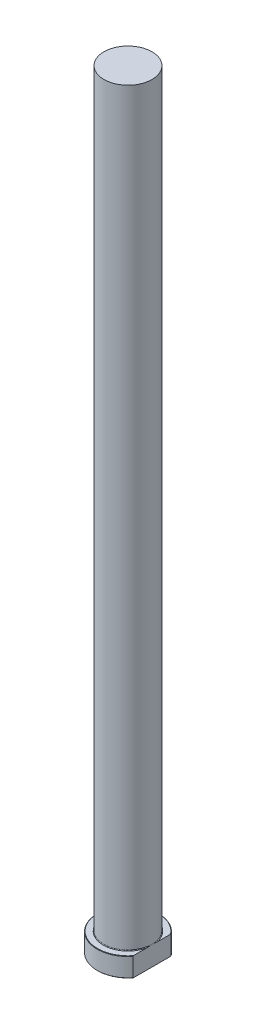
ISO-10303-21;
HEADER;
FILE_DESCRIPTION(('STEP AP214'),'2;1');
FILE_NAME('part.step','',(''),(''),'','','');
FILE_SCHEMA(('AUTOMOTIVE_DESIGN { 1 0 10303 214 1 1 1 1 }'));
ENDSEC;
DATA;
#1=APPLICATION_CONTEXT('core data for automotive mechanical design processes');
#2=APPLICATION_PROTOCOL_DEFINITION('international standard','automotive_design',2000,#1);
#3=PRODUCT_CONTEXT('',#1,'mechanical');
#4=PRODUCT('Part','Part','',(#3));
#5=PRODUCT_RELATED_PRODUCT_CATEGORY('part','',(#4));
#6=PRODUCT_DEFINITION_FORMATION('','',#4);
#7=PRODUCT_DEFINITION_CONTEXT('part definition',#1,'design');
#8=PRODUCT_DEFINITION('design','',#6,#7);
#9=PRODUCT_DEFINITION_SHAPE('','',#8);
#10=(LENGTH_UNIT() NAMED_UNIT(*) SI_UNIT(.MILLI.,.METRE.));
#11=(NAMED_UNIT(*) PLANE_ANGLE_UNIT() SI_UNIT($,.RADIAN.));
#12=(NAMED_UNIT(*) SI_UNIT($,.STERADIAN.) SOLID_ANGLE_UNIT());
#13=UNCERTAINTY_MEASURE_WITH_UNIT(LENGTH_MEASURE(1.E-05),#10,'distance_accuracy_value','');
#14=(GEOMETRIC_REPRESENTATION_CONTEXT(3) GLOBAL_UNCERTAINTY_ASSIGNED_CONTEXT((#13)) GLOBAL_UNIT_ASSIGNED_CONTEXT((#10,
#11,#12)) REPRESENTATION_CONTEXT('',''));
#15=CARTESIAN_POINT('',(0.,0.,0.));
#16=DIRECTION('',(0.,0.,1.));
#17=DIRECTION('',(1.,0.,0.));
#18=AXIS2_PLACEMENT_3D('',#15,#16,#17);
#19=CARTESIAN_POINT('',(0.,0.,0.));
#20=DIRECTION('',(0.,-1.,0.));
#21=DIRECTION('',(0.,0.,-1.));
#22=AXIS2_PLACEMENT_3D('',#19,#20,#21);
#23=PLANE('',#22);
#24=CARTESIAN_POINT('',(0.,0.,0.));
#25=DIRECTION('',(0.,-1.,0.));
#26=DIRECTION('',(0.,0.,-1.));
#27=AXIS2_PLACEMENT_3D('',#24,#25,#26);
#28=CIRCLE('',#27,15.8);
#29=CARTESIAN_POINT('',(12.5,0.,9.66385016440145));
#30=VERTEX_POINT('',#29);
#31=CARTESIAN_POINT('',(12.5,0.,-9.66385016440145));
#32=VERTEX_POINT('',#31);
#33=EDGE_CURVE('E98',#30,#32,#28,.T.);
#34=ORIENTED_EDGE('',*,*,#33,.T.);
#35=DIRECTION('',(0.,0.,1.));
#36=VECTOR('',#35,1.);
#37=CARTESIAN_POINT('',(12.5,0.,-9.98749217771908));
#38=LINE('',#37,#36);
#39=EDGE_CURVE('E83',#32,#30,#38,.T.);
#40=ORIENTED_EDGE('',*,*,#39,.T.);
#41=EDGE_LOOP('',(#34,#40));
#42=FACE_BOUND('',#41,.T.);
#43=ADVANCED_FACE('F32',(#42),#23,.T.);
#44=CARTESIAN_POINT('',(0.,259.958771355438,0.));
#45=DIRECTION('',(0.,1.,0.));
#46=DIRECTION('',(0.,0.,1.));
#47=AXIS2_PLACEMENT_3D('',#44,#45,#46);
#48=CYLINDRICAL_SURFACE('',#47,16.);
#49=CARTESIAN_POINT('',(0.,9.80000000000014,0.));
#50=DIRECTION('',(0.,1.,0.));
#51=DIRECTION('',(0.,0.,1.));
#52=AXIS2_PLACEMENT_3D('',#49,#50,#51);
#53=CIRCLE('',#52,16.);
#54=CARTESIAN_POINT('',(12.5,9.80000000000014,9.98749217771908));
#55=VERTEX_POINT('',#54);
#56=CARTESIAN_POINT('',(12.5,9.80000000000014,-9.98749217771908));
#57=VERTEX_POINT('',#56);
#58=EDGE_CURVE('E104',#55,#57,#53,.F.);
#59=ORIENTED_EDGE('',*,*,#58,.T.);
#60=DIRECTION('',(0.,-1.,0.));
#61=VECTOR('',#60,1.);
#62=CARTESIAN_POINT('',(12.5,400.,-9.98749217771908));
#63=LINE('',#62,#61);
#64=CARTESIAN_POINT('',(12.5,0.199999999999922,-9.98749217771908));
#65=VERTEX_POINT('',#64);
#66=EDGE_CURVE('E183',#57,#65,#63,.T.);
#67=ORIENTED_EDGE('',*,*,#66,.T.);
#68=CARTESIAN_POINT('',(0.,0.199999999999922,0.));
#69=DIRECTION('',(0.,-1.,0.));
#70=DIRECTION('',(0.,0.,-1.));
#71=AXIS2_PLACEMENT_3D('',#68,#69,#70);
#72=CIRCLE('',#71,16.);
#73=CARTESIAN_POINT('',(12.5,0.199999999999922,9.98749217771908));
#74=VERTEX_POINT('',#73);
#75=EDGE_CURVE('E100',#65,#74,#72,.F.);
#76=ORIENTED_EDGE('',*,*,#75,.T.);
#77=DIRECTION('',(0.,-1.,0.));
#78=VECTOR('',#77,1.);
#79=CARTESIAN_POINT('',(12.5,400.,9.98749217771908));
#80=LINE('',#79,#78);
#81=EDGE_CURVE('E93',#55,#74,#80,.T.);
#82=ORIENTED_EDGE('',*,*,#81,.F.);
#83=EDGE_LOOP('',(#59,#67,#76,#82));
#84=FACE_BOUND('',#83,.T.);
#85=ADVANCED_FACE('F158',(#84),#48,.T.);
#86=CARTESIAN_POINT('',(-16.,10.,0.));
#87=DIRECTION('',(0.,1.,0.));
#88=DIRECTION('',(0.,0.,1.));
#89=AXIS2_PLACEMENT_3D('',#86,#87,#88);
#90=PLANE('',#89);
#91=CARTESIAN_POINT('',(0.,10.,0.));
#92=DIRECTION('',(0.,1.,0.));
#93=DIRECTION('',(0.,0.,1.));
#94=AXIS2_PLACEMENT_3D('',#91,#92,#93);
#95=CIRCLE('',#94,15.8000000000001);
#96=CARTESIAN_POINT('',(12.5,10.,-9.66385016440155));
#97=VERTEX_POINT('',#96);
#98=CARTESIAN_POINT('',(12.5,10.,9.66385016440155));
#99=VERTEX_POINT('',#98);
#100=EDGE_CURVE('E178',#97,#99,#95,.T.);
#101=ORIENTED_EDGE('',*,*,#100,.T.);
#102=DIRECTION('',(0.,0.,-1.));
#103=VECTOR('',#102,1.);
#104=CARTESIAN_POINT('',(12.5,10.,0.));
#105=LINE('',#104,#103);
#106=CARTESIAN_POINT('',(12.5,10.,2.75499546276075));
#107=VERTEX_POINT('',#106);
#108=EDGE_CURVE('E57',#99,#107,#105,.T.);
#109=ORIENTED_EDGE('',*,*,#108,.T.);
#110=CARTESIAN_POINT('',(0.,10.,0.));
#111=DIRECTION('',(0.,1.,0.));
#112=DIRECTION('',(0.,0.,1.));
#113=AXIS2_PLACEMENT_3D('',#110,#111,#112);
#114=CIRCLE('',#113,12.8);
#115=CARTESIAN_POINT('',(12.5,10.,-2.75499546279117));
#116=VERTEX_POINT('',#115);
#117=EDGE_CURVE('E107',#107,#116,#114,.F.);
#118=ORIENTED_EDGE('',*,*,#117,.T.);
#119=EDGE_CURVE('E136',#116,#97,#105,.T.);
#120=ORIENTED_EDGE('',*,*,#119,.T.);
#121=EDGE_LOOP('',(#101,#109,#118,#120));
#122=FACE_BOUND('',#121,.T.);
#123=ADVANCED_FACE('F147',(#122),#90,.T.);
#124=CARTESIAN_POINT('',(0.,10.,0.));
#125=DIRECTION('',(0.,-1.,0.));
#126=DIRECTION('',(0.,0.,-1.));
#127=AXIS2_PLACEMENT_3D('',#124,#125,#126);
#128=CONICAL_SURFACE('',#127,15.8000000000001,0.785398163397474);
#129=ORIENTED_EDGE('',*,*,#58,.F.);
#130=CARTESIAN_POINT('',(12.5,0.520063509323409,21.9732835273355));
#131=CARTESIAN_POINT('',(12.5,0.802025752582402,21.6488770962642));
#132=CARTESIAN_POINT('',(12.5,1.08313217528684,21.3237240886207));
#133=CARTESIAN_POINT('',(12.5,1.64338244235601,20.6717229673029));
#134=CARTESIAN_POINT('',(12.5,1.9225262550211,20.3448748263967));
#135=CARTESIAN_POINT('',(12.5,2.47872061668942,19.689139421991));
#136=CARTESIAN_POINT('',(12.5,2.75577013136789,19.3602512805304));
#137=CARTESIAN_POINT('',(12.5,3.30732757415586,18.7003513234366));
#138=CARTESIAN_POINT('',(12.5,3.58183551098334,18.3693395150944));
#139=CARTESIAN_POINT('',(12.5,4.13404626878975,17.6974852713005));
#140=CARTESIAN_POINT('',(12.5,4.411683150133,17.3565885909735));
#141=CARTESIAN_POINT('',(12.5,4.96342557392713,16.6719500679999));
#142=CARTESIAN_POINT('',(12.5,5.23753113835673,16.3282082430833));
#143=CARTESIAN_POINT('',(12.5,5.7815597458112,15.6375575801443));
#144=CARTESIAN_POINT('',(12.5,6.05148375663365,15.2906495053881));
#145=CARTESIAN_POINT('',(12.5,6.58649101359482,14.5931154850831));
#146=CARTESIAN_POINT('',(12.5,6.85157426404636,14.2424895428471));
#147=CARTESIAN_POINT('',(12.5,7.3763396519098,13.5365100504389));
#148=CARTESIAN_POINT('',(12.5,7.6360143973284,13.1811509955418));
#149=CARTESIAN_POINT('',(12.5,8.14848411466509,12.4654890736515));
#150=CARTESIAN_POINT('',(12.5,8.40127901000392,12.1051861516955));
#151=CARTESIAN_POINT('',(12.5,8.89877262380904,11.3785626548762));
#152=CARTESIAN_POINT('',(12.5,9.14346420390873,11.0122371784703));
#153=CARTESIAN_POINT('',(12.5,9.62269650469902,10.272992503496));
#154=CARTESIAN_POINT('',(12.5,9.8572374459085,9.90007344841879));
#155=CARTESIAN_POINT('',(12.5,10.3121733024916,9.14938704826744));
#156=CARTESIAN_POINT('',(12.5,10.5326589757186,8.77167495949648));
#157=CARTESIAN_POINT('',(12.5,10.958432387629,8.00766886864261));
#158=CARTESIAN_POINT('',(12.5,11.1637182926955,7.62137383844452));
#159=CARTESIAN_POINT('',(12.5,11.5550521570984,6.83979556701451));
#160=CARTESIAN_POINT('',(12.5,11.7411279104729,6.44452635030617));
#161=CARTESIAN_POINT('',(12.5,12.0896891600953,5.64379531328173));
#162=CARTESIAN_POINT('',(12.5,12.2521837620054,5.23833749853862));
#163=CARTESIAN_POINT('',(12.5,12.5515074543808,4.40750298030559));
#164=CARTESIAN_POINT('',(12.5,12.6876692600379,3.98188300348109));
#165=CARTESIAN_POINT('',(12.5,12.923066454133,3.12036018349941));
#166=CARTESIAN_POINT('',(12.5,13.0223077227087,2.68445898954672));
#167=CARTESIAN_POINT('',(12.5,13.1386499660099,2.02637177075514));
#168=CARTESIAN_POINT('',(12.5,13.1719581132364,1.80697979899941));
#169=CARTESIAN_POINT('',(12.5,13.2273896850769,1.36679892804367));
#170=CARTESIAN_POINT('',(12.5,13.2495147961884,1.14601024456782));
#171=CARTESIAN_POINT('',(12.5,13.2821590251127,0.70357819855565));
#172=CARTESIAN_POINT('',(12.5,13.2926782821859,0.481934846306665));
#173=CARTESIAN_POINT('',(12.5,13.3019073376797,0.0383999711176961));
#174=CARTESIAN_POINT('',(12.5,13.3006171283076,-0.18349155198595));
#175=CARTESIAN_POINT('',(12.5,13.2862386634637,-0.627300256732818));
#176=CARTESIAN_POINT('',(12.5,13.2731286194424,-0.849216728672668));
#177=CARTESIAN_POINT('',(12.5,13.2353379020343,-1.29205679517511));
#178=CARTESIAN_POINT('',(12.5,13.2106571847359,-1.51298038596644));
#179=CARTESIAN_POINT('',(12.5,13.1501829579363,-1.9533130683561));
#180=CARTESIAN_POINT('',(12.5,13.1143886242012,-2.17272204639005));
#181=CARTESIAN_POINT('',(12.5,13.0323124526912,-2.60958138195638));
#182=CARTESIAN_POINT('',(12.5,12.986029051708,-2.82703144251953));
#183=CARTESIAN_POINT('',(12.5,12.831800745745,-3.47896053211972));
#184=CARTESIAN_POINT('',(12.5,12.7089145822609,-3.90995974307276));
#185=CARTESIAN_POINT('',(12.5,12.4301044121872,-4.76088311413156));
#186=CARTESIAN_POINT('',(12.5,12.2741797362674,-5.18080704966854));
#187=CARTESIAN_POINT('',(12.5,11.8998555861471,-6.09704545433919));
#188=CARTESIAN_POINT('',(12.5,11.6752155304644,-6.59079268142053));
#189=CARTESIAN_POINT('',(12.5,11.195925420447,-7.5636180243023));
#190=CARTESIAN_POINT('',(12.5,10.9412581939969,-8.04268754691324));
#191=CARTESIAN_POINT('',(12.5,10.4085643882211,-8.98884891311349));
#192=CARTESIAN_POINT('',(12.5,10.1304909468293,-9.45591416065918));
#193=CARTESIAN_POINT('',(12.5,9.55679554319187,-10.3789360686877));
#194=CARTESIAN_POINT('',(12.5,9.26117703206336,-10.8348948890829));
#195=CARTESIAN_POINT('',(12.5,8.65460060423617,-11.7400212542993));
#196=CARTESIAN_POINT('',(12.5,8.34356847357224,-12.1891388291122));
#197=CARTESIAN_POINT('',(12.5,7.71056360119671,-13.0795913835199));
#198=CARTESIAN_POINT('',(12.5,7.38859046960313,-13.5209260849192));
#199=CARTESIAN_POINT('',(12.5,6.73627073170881,-14.3965599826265));
#200=CARTESIAN_POINT('',(12.5,6.40593412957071,-14.8308666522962));
#201=CARTESIAN_POINT('',(12.5,5.73818513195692,-15.69398428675));
#202=CARTESIAN_POINT('',(12.5,5.4007728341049,-16.1227953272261));
#203=CARTESIAN_POINT('',(12.5,4.69065889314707,-17.0127103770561));
#204=CARTESIAN_POINT('',(12.5,4.31743190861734,-17.473394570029));
#205=CARTESIAN_POINT('',(12.5,3.56536441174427,-18.3901509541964));
#206=CARTESIAN_POINT('',(12.5,3.18652389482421,-18.8462231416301));
#207=CARTESIAN_POINT('',(12.5,2.42850462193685,-19.7493414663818));
#208=CARTESIAN_POINT('',(12.5,2.04937794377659,-20.1964313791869));
#209=CARTESIAN_POINT('',(12.5,1.28737664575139,-21.0872319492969));
#210=CARTESIAN_POINT('',(12.5,0.90450289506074,-21.5309433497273));
#211=CARTESIAN_POINT('',(12.5,0.520063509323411,-21.9732835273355));
#212=B_SPLINE_CURVE_WITH_KNOTS('',3,(#130,#131,#132,#133,#134,#135,#136,#137,#138,#139,#140,
#141,#142,#143,#144,#145,#146,#147,#148,#149,#150,#151,#152,#153,#154,#155,#156,#157,#158,#159,
#160,#161,#162,#163,#164,#165,#166,#167,#168,#169,#170,#171,#172,#173,#174,#175,#176,#177,#178,
#179,#180,#181,#182,#183,#184,#185,#186,#187,#188,#189,#190,#191,#192,#193,#194,#195,#196,#197,
#198,#199,#200,#201,#202,#203,#204,#205,#206,#207,#208,#209,#210,#211),.UNSPECIFIED.,.F.,.F.,(4,
2,2,2,2,2,2,2,2,2,2,2,2,2,2,2,2,2,2,2,2,2,2,2,2,2,2,2,2,2,2,2,2,2,2,2,2,2,2,2,4),(0.,
1.28945110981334,2.57892299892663,3.86899482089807,5.15906221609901,6.47799420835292,
7.79691798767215,9.11553180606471,10.4341444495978,11.7544545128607,13.0747792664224,
14.3962377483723,15.7176675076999,17.0294519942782,18.3413944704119,19.6514113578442,
20.9609210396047,22.3001940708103,23.6392537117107,24.3047314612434,24.9701088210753,
25.6354781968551,26.3008480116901,26.9674468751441,27.6340482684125,28.3006991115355,
28.9674493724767,30.3101828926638,31.6529436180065,33.2788964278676,34.9057836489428,
36.5360093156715,38.1659153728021,39.804623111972,41.4433893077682,43.0802801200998,
44.7171483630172,46.4957886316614,48.274430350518,50.0329971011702,51.7911651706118),.UNSPECIFIED.);
#213=EDGE_CURVE('E135',#55,#99,#212,.T.);
#214=ORIENTED_EDGE('',*,*,#213,.T.);
#215=ORIENTED_EDGE('',*,*,#100,.F.);
#216=EDGE_CURVE('E127',#97,#57,#212,.T.);
#217=ORIENTED_EDGE('',*,*,#216,.T.);
#218=EDGE_LOOP('',(#129,#214,#215,#217));
#219=FACE_BOUND('',#218,.T.);
#220=ADVANCED_FACE('F143',(#219),#128,.T.);
#221=CARTESIAN_POINT('',(0.,0.199999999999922,0.));
#222=DIRECTION('',(0.,1.,0.));
#223=DIRECTION('',(0.,0.,1.));
#224=AXIS2_PLACEMENT_3D('',#221,#222,#223);
#225=CONICAL_SURFACE('',#224,16.,0.785398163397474);
#226=ORIENTED_EDGE('',*,*,#75,.F.);
#227=CARTESIAN_POINT('',(12.5,9.47993649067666,-21.9732835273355));
#228=CARTESIAN_POINT('',(12.5,9.19797424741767,-21.6488770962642));
#229=CARTESIAN_POINT('',(12.5,8.91686782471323,-21.3237240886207));
#230=CARTESIAN_POINT('',(12.5,8.35661755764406,-20.6717229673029));
#231=CARTESIAN_POINT('',(12.5,8.07747374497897,-20.3448748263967));
#232=CARTESIAN_POINT('',(12.5,7.52127938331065,-19.689139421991));
#233=CARTESIAN_POINT('',(12.5,7.24422986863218,-19.3602512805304));
#234=CARTESIAN_POINT('',(12.5,6.69267242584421,-18.7003513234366));
#235=CARTESIAN_POINT('',(12.5,6.41816448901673,-18.3693395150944));
#236=CARTESIAN_POINT('',(12.5,5.86595373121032,-17.6974852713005));
#237=CARTESIAN_POINT('',(12.5,5.58831684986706,-17.3565885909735));
#238=CARTESIAN_POINT('',(12.5,5.03657442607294,-16.6719500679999));
#239=CARTESIAN_POINT('',(12.5,4.76246886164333,-16.3282082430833));
#240=CARTESIAN_POINT('',(12.5,4.21844025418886,-15.6375575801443));
#241=CARTESIAN_POINT('',(12.5,3.94851624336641,-15.2906495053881));
#242=CARTESIAN_POINT('',(12.5,3.41350898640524,-14.5931154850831));
#243=CARTESIAN_POINT('',(12.5,3.14842573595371,-14.2424895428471));
#244=CARTESIAN_POINT('',(12.5,2.62366034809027,-13.5365100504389));
#245=CARTESIAN_POINT('',(12.5,2.36398560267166,-13.1811509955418));
#246=CARTESIAN_POINT('',(12.5,1.85151588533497,-12.4654890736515));
#247=CARTESIAN_POINT('',(12.5,1.59872098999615,-12.1051861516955));
#248=CARTESIAN_POINT('',(12.5,1.10122737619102,-11.3785626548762));
#249=CARTESIAN_POINT('',(12.5,0.856535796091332,-11.0122371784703));
#250=CARTESIAN_POINT('',(12.5,0.377303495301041,-10.272992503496));
#251=CARTESIAN_POINT('',(12.5,0.142762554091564,-9.90007344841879));
#252=CARTESIAN_POINT('',(12.5,-0.312173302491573,-9.14938704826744));
#253=CARTESIAN_POINT('',(12.5,-0.532658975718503,-8.77167495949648));
#254=CARTESIAN_POINT('',(12.5,-0.958432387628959,-8.00766886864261));
#255=CARTESIAN_POINT('',(12.5,-1.16371829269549,-7.62137383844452));
#256=CARTESIAN_POINT('',(12.5,-1.55505215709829,-6.83979556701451));
#257=CARTESIAN_POINT('',(12.5,-1.74112791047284,-6.44452635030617));
#258=CARTESIAN_POINT('',(12.5,-2.08968916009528,-5.64379531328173));
#259=CARTESIAN_POINT('',(12.5,-2.25218376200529,-5.23833749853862));
#260=CARTESIAN_POINT('',(12.5,-2.55150745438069,-4.40750298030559));
#261=CARTESIAN_POINT('',(12.5,-2.68766926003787,-3.98188300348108));
#262=CARTESIAN_POINT('',(12.5,-2.92306645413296,-3.1203601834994));
#263=CARTESIAN_POINT('',(12.5,-3.02230772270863,-2.68445898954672));
#264=CARTESIAN_POINT('',(12.5,-3.13864996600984,-2.02637177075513));
#265=CARTESIAN_POINT('',(12.5,-3.17195811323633,-1.80697979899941));
#266=CARTESIAN_POINT('',(12.5,-3.22738968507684,-1.36679892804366));
#267=CARTESIAN_POINT('',(12.5,-3.24951479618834,-1.14601024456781));
#268=CARTESIAN_POINT('',(12.5,-3.28215902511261,-0.703578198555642));
#269=CARTESIAN_POINT('',(12.5,-3.29267828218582,-0.481934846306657));
#270=CARTESIAN_POINT('',(12.5,-3.30190733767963,-0.038399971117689));
#271=CARTESIAN_POINT('',(12.5,-3.30061712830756,0.183491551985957));
#272=CARTESIAN_POINT('',(12.5,-3.28623866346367,0.627300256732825));
#273=CARTESIAN_POINT('',(12.5,-3.27312861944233,0.849216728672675));
#274=CARTESIAN_POINT('',(12.5,-3.23533790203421,1.29205679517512));
#275=CARTESIAN_POINT('',(12.5,-3.21065718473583,1.51298038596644));
#276=CARTESIAN_POINT('',(12.5,-3.15018295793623,1.95331306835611));
#277=CARTESIAN_POINT('',(12.5,-3.11438862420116,2.17272204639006));
#278=CARTESIAN_POINT('',(12.5,-3.03231245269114,2.60958138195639));
#279=CARTESIAN_POINT('',(12.5,-2.98602905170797,2.82703144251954));
#280=CARTESIAN_POINT('',(12.5,-2.83180074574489,3.47896053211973));
#281=CARTESIAN_POINT('',(12.5,-2.70891458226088,3.90995974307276));
#282=CARTESIAN_POINT('',(12.5,-2.43010441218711,4.76088311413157));
#283=CARTESIAN_POINT('',(12.5,-2.27417973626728,5.18080704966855));
#284=CARTESIAN_POINT('',(12.5,-1.89985558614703,6.09704545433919));
#285=CARTESIAN_POINT('',(12.5,-1.67521553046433,6.59079268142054));
#286=CARTESIAN_POINT('',(12.5,-1.19592542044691,7.56361802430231));
#287=CARTESIAN_POINT('',(12.5,-0.941258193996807,8.04268754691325));
#288=CARTESIAN_POINT('',(12.5,-0.408564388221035,8.98884891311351));
#289=CARTESIAN_POINT('',(12.5,-0.130490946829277,9.45591416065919));
#290=CARTESIAN_POINT('',(12.5,0.443204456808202,10.3789360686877));
#291=CARTESIAN_POINT('',(12.5,0.738822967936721,10.8348948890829));
#292=CARTESIAN_POINT('',(12.5,1.34539939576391,11.7400212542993));
#293=CARTESIAN_POINT('',(12.5,1.65643152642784,12.1891388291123));
#294=CARTESIAN_POINT('',(12.5,2.28943639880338,13.0795913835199));
#295=CARTESIAN_POINT('',(12.5,2.61140953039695,13.5209260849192));
#296=CARTESIAN_POINT('',(12.5,3.26372926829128,14.3965599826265));
#297=CARTESIAN_POINT('',(12.5,3.59406587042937,14.8308666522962));
#298=CARTESIAN_POINT('',(12.5,4.26181486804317,15.69398428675));
#299=CARTESIAN_POINT('',(12.5,4.59922716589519,16.1227953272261));
#300=CARTESIAN_POINT('',(12.5,5.30934110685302,17.0127103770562));
#301=CARTESIAN_POINT('',(12.5,5.68256809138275,17.473394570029));
#302=CARTESIAN_POINT('',(12.5,6.43463558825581,18.3901509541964));
#303=CARTESIAN_POINT('',(12.5,6.81347610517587,18.8462231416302));
#304=CARTESIAN_POINT('',(12.5,7.57149537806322,19.7493414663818));
#305=CARTESIAN_POINT('',(12.5,7.95062205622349,20.1964313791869));
#306=CARTESIAN_POINT('',(12.5,8.71262335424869,21.0872319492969));
#307=CARTESIAN_POINT('',(12.5,9.09549710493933,21.5309433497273));
#308=CARTESIAN_POINT('',(12.5,9.47993649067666,21.9732835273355));
#309=B_SPLINE_CURVE_WITH_KNOTS('',3,(#227,#228,#229,#230,#231,#232,#233,#234,#235,#236,#237,
#238,#239,#240,#241,#242,#243,#244,#245,#246,#247,#248,#249,#250,#251,#252,#253,#254,#255,#256,
#257,#258,#259,#260,#261,#262,#263,#264,#265,#266,#267,#268,#269,#270,#271,#272,#273,#274,#275,
#276,#277,#278,#279,#280,#281,#282,#283,#284,#285,#286,#287,#288,#289,#290,#291,#292,#293,#294,
#295,#296,#297,#298,#299,#300,#301,#302,#303,#304,#305,#306,#307,#308),.UNSPECIFIED.,.F.,.F.,(4,
2,2,2,2,2,2,2,2,2,2,2,2,2,2,2,2,2,2,2,2,2,2,2,2,2,2,2,2,2,2,2,2,2,2,2,2,2,2,2,4),(0.,
1.28945110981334,2.57892299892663,3.86899482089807,5.15906221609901,6.47799420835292,
7.79691798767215,9.11553180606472,10.4341444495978,11.7544545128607,13.0747792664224,
14.3962377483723,15.7176675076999,17.0294519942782,18.3413944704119,19.6514113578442,
20.9609210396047,22.3001940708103,23.6392537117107,24.3047314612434,24.9701088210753,
25.6354781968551,26.3008480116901,26.9674468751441,27.6340482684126,28.3006991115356,
28.9674493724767,30.3101828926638,31.6529436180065,33.2788964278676,34.9057836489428,
36.5360093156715,38.1659153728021,39.8046231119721,41.4433893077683,43.0802801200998,
44.7171483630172,46.4957886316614,48.2744303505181,50.0329971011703,51.7911651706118),.UNSPECIFIED.);
#310=EDGE_CURVE('E86',#65,#32,#309,.T.);
#311=ORIENTED_EDGE('',*,*,#310,.T.);
#312=ORIENTED_EDGE('',*,*,#33,.F.);
#313=EDGE_CURVE('E89',#30,#74,#309,.T.);
#314=ORIENTED_EDGE('',*,*,#313,.T.);
#315=EDGE_LOOP('',(#226,#311,#312,#314));
#316=FACE_BOUND('',#315,.T.);
#317=ADVANCED_FACE('F97',(#316),#225,.T.);
#318=CARTESIAN_POINT('',(0.,10.3,0.));
#319=DIRECTION('',(0.,1.,0.));
#320=DIRECTION('',(0.,0.,1.));
#321=AXIS2_PLACEMENT_3D('',#318,#319,#320);
#322=TOROIDAL_SURFACE('',#321,12.8,0.3);
#323=CARTESIAN_POINT('',(12.5,10.3,0.));
#324=CARTESIAN_POINT('',(12.5,10.300000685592,-6.08820746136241E-09));
#325=CARTESIAN_POINT('',(12.5,10.300001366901,-5.08876655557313E-07));
#326=CARTESIAN_POINT('',(12.5,10.3000026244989,-1.73661802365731E-06));
#327=CARTESIAN_POINT('',(12.5,10.3000031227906,-2.48490474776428E-06));
#328=CARTESIAN_POINT('',(12.5,10.3000042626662,-4.35291163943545E-06));
#329=CARTESIAN_POINT('',(12.5,10.3000048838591,-5.50325566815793E-06));
#330=CARTESIAN_POINT('',(12.5,10.3000058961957,-7.76527023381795E-06));
#331=CARTESIAN_POINT('',(12.5,10.3000063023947,-8.87193032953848E-06));
#332=CARTESIAN_POINT('',(12.5,10.3000080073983,-1.35535117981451E-05));
#333=CARTESIAN_POINT('',(12.5,10.300009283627,-1.71478698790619E-05));
#334=CARTESIAN_POINT('',(12.5,10.3000111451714,-2.39305737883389E-05));
#335=CARTESIAN_POINT('',(12.5,10.30001180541,-2.70989461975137E-05));
#336=CARTESIAN_POINT('',(12.5,10.3000165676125,-5.05411717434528E-05));
#337=CARTESIAN_POINT('',(12.5,10.3000200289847,-7.09185071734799E-05));
#338=CARTESIAN_POINT('',(12.5,10.300032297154,-0.000151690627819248));
#339=CARTESIAN_POINT('',(12.5,10.3000383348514,-0.000212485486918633));
#340=CARTESIAN_POINT('',(12.5,10.3000659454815,-0.000448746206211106));
#341=CARTESIAN_POINT('',(12.5,10.3000952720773,-0.000623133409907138));
#342=CARTESIAN_POINT('',(12.5,10.3002039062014,-0.00128772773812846));
#343=CARTESIAN_POINT('',(12.5,10.3002776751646,-0.00177866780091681));
#344=CARTESIAN_POINT('',(12.5,10.3005641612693,-0.00366503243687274));
#345=CARTESIAN_POINT('',(12.5,10.3007823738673,-0.00505974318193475));
#346=CARTESIAN_POINT('',(12.5,10.3018133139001,-0.0116680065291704));
#347=CARTESIAN_POINT('',(12.5,10.3026180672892,-0.0168825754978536));
#348=CARTESIAN_POINT('',(12.5,10.3120514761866,-0.0779781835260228));
#349=CARTESIAN_POINT('',(12.5,10.3207244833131,-0.133853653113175));
#350=CARTESIAN_POINT('',(12.5,10.3388658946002,-0.251282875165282));
#351=CARTESIAN_POINT('',(12.5,10.3483257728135,-0.312837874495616));
#352=CARTESIAN_POINT('',(12.5,10.3639287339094,-0.415046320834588));
#353=CARTESIAN_POINT('',(12.5,10.3701065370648,-0.455694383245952));
#354=CARTESIAN_POINT('',(12.5,10.3822268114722,-0.53596333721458));
#355=CARTESIAN_POINT('',(12.5,10.3881712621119,-0.57558393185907));
#356=CARTESIAN_POINT('',(12.5,10.4217048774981,-0.800849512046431));
#357=CARTESIAN_POINT('',(12.5,10.4483430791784,-0.986638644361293));
#358=CARTESIAN_POINT('',(12.5,10.4978676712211,-1.36073085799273));
#359=CARTESIAN_POINT('',(12.5,10.5207116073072,-1.54903981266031));
#360=CARTESIAN_POINT('',(12.5,10.5510813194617,-1.84372746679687));
#361=CARTESIAN_POINT('',(12.5,10.5609338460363,-1.94986334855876));
#362=CARTESIAN_POINT('',(12.5,10.5778401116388,-2.16235517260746));
#363=CARTESIAN_POINT('',(12.5,10.5848941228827,-2.26871109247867));
#364=CARTESIAN_POINT('',(12.5,10.5953321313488,-2.48120575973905));
#365=CARTESIAN_POINT('',(12.5,10.5987299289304,-2.58734380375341));
#366=CARTESIAN_POINT('',(12.5,10.6006981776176,-2.79965289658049));
#367=CARTESIAN_POINT('',(12.5,10.5992708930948,-2.90582390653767));
#368=CARTESIAN_POINT('',(12.5,10.5920660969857,-3.06242328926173));
#369=CARTESIAN_POINT('',(12.5,10.5889531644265,-3.11297361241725));
#370=CARTESIAN_POINT('',(12.5,10.5807735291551,-3.21396863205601));
#371=CARTESIAN_POINT('',(12.5,10.5757051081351,-3.26441319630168));
#372=CARTESIAN_POINT('',(12.5,10.5631618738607,-3.36425835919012));
#373=CARTESIAN_POINT('',(12.5,10.555723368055,-3.41366343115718));
#374=CARTESIAN_POINT('',(12.5,10.5375916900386,-3.51185380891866));
#375=CARTESIAN_POINT('',(12.5,10.5269024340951,-3.56063978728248));
#376=CARTESIAN_POINT('',(12.5,10.5054348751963,-3.6391830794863));
#377=CARTESIAN_POINT('',(12.5,10.4961365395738,-3.66933696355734));
#378=CARTESIAN_POINT('',(12.5,10.474763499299,-3.72862196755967));
#379=CARTESIAN_POINT('',(12.5,10.462694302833,-3.75775498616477));
#380=CARTESIAN_POINT('',(12.5,10.4380385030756,-3.80618627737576));
#381=CARTESIAN_POINT('',(12.5,10.4265070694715,-3.8259857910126));
#382=CARTESIAN_POINT('',(12.5,10.4063926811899,-3.85382979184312));
#383=CARTESIAN_POINT('',(12.5,10.3991733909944,-3.8628437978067));
#384=CARTESIAN_POINT('',(12.5,10.3835233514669,-3.87975615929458));
#385=CARTESIAN_POINT('',(12.5,10.3750969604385,-3.88765833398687));
#386=CARTESIAN_POINT('',(12.5,10.3611065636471,-3.89824999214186));
#387=CARTESIAN_POINT('',(12.5,10.3560749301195,-3.9016366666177));
#388=CARTESIAN_POINT('',(12.5,10.3455861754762,-3.90768435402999));
#389=CARTESIAN_POINT('',(12.5,10.3401292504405,-3.91034569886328));
#390=CARTESIAN_POINT('',(12.5,10.3287657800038,-3.91474619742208));
#391=CARTESIAN_POINT('',(12.5,10.3228544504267,-3.91647335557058));
#392=CARTESIAN_POINT('',(12.5,10.3108092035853,-3.91873417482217));
#393=CARTESIAN_POINT('',(12.5,10.3046756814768,-3.91926985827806));
#394=CARTESIAN_POINT('',(12.5,10.293185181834,-3.91908606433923));
#395=CARTESIAN_POINT('',(12.5,10.2878253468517,-3.91851265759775));
#396=CARTESIAN_POINT('',(12.5,10.2772818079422,-3.91645967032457));
#397=CARTESIAN_POINT('',(12.5,10.2720982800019,-3.91497921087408));
#398=CARTESIAN_POINT('',(12.5,10.2604757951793,-3.91068184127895));
#399=CARTESIAN_POINT('',(12.5,10.2541380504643,-3.90759459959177));
#400=CARTESIAN_POINT('',(12.5,10.2420308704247,-3.90046137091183));
#401=CARTESIAN_POINT('',(12.5,10.2362627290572,-3.89641326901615));
#402=CARTESIAN_POINT('',(12.5,10.2213149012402,-3.88449159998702));
#403=CARTESIAN_POINT('',(12.5,10.2126659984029,-3.87596096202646));
#404=CARTESIAN_POINT('',(12.5,10.1966439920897,-3.85778795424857));
#405=CARTESIAN_POINT('',(12.5,10.1892747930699,-3.84814232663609));
#406=CARTESIAN_POINT('',(12.5,10.1725709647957,-3.82389784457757));
#407=CARTESIAN_POINT('',(12.5,10.1637497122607,-3.80894948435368));
#408=CARTESIAN_POINT('',(12.5,10.1475318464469,-3.77828784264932));
#409=CARTESIAN_POINT('',(12.5,10.1401383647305,-3.76257297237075));
#410=CARTESIAN_POINT('',(12.5,10.1264047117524,-3.73059893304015));
#411=CARTESIAN_POINT('',(12.5,10.1200701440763,-3.71433738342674));
#412=CARTESIAN_POINT('',(12.5,10.1082745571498,-3.68152468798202));
#413=CARTESIAN_POINT('',(12.5,10.1028126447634,-3.66497385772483));
#414=CARTESIAN_POINT('',(12.5,10.0886990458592,-3.61898372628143));
#415=CARTESIAN_POINT('',(12.5,10.0807822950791,-3.58931942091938));
#416=CARTESIAN_POINT('',(12.5,10.0665587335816,-3.52960268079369));
#417=CARTESIAN_POINT('',(12.5,10.0602528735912,-3.49955002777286));
#418=CARTESIAN_POINT('',(12.5,10.0432020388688,-3.40892020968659));
#419=CARTESIAN_POINT('',(12.5,10.0343558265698,-3.34798718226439));
#420=CARTESIAN_POINT('',(12.5,10.0201228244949,-3.22565891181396));
#421=CARTESIAN_POINT('',(12.5,10.0147414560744,-3.16426309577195));
#422=CARTESIAN_POINT('',(12.5,10.0066240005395,-3.04138251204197));
#423=CARTESIAN_POINT('',(12.5,10.0038844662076,-2.97989796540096));
#424=CARTESIAN_POINT('',(12.5,10.0005131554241,-2.8577235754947));
#425=CARTESIAN_POINT('',(12.5,9.99985290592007,-2.79703443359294));
#426=CARTESIAN_POINT('',(12.5,10.0002004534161,-2.67565900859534));
#427=CARTESIAN_POINT('',(12.5,10.0012083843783,-2.61497272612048));
#428=CARTESIAN_POINT('',(12.5,10.0063170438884,-2.43292800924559));
#429=CARTESIAN_POINT('',(12.5,10.0125034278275,-2.31162822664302));
#430=CARTESIAN_POINT('',(12.5,10.028923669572,-2.06913309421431));
#431=CARTESIAN_POINT('',(12.5,10.0391638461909,-1.94793820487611));
#432=CARTESIAN_POINT('',(12.5,10.0626694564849,-1.70583328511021));
#433=CARTESIAN_POINT('',(12.5,10.0759352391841,-1.58492328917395));
#434=CARTESIAN_POINT('',(12.5,10.1189883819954,-1.22310927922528));
#435=CARTESIAN_POINT('',(12.5,10.1520738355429,-0.982605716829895));
#436=CARTESIAN_POINT('',(12.5,10.2222679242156,-0.502161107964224));
#437=CARTESIAN_POINT('',(12.5,10.2593775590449,-0.262220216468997));
#438=CARTESIAN_POINT('',(12.5,10.2965571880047,-0.0222236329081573));
#439=CARTESIAN_POINT('',(12.5,10.2965669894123,-0.0221603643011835));
#440=CARTESIAN_POINT('',(12.5,10.2972687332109,-0.017630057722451));
#441=CARTESIAN_POINT('',(12.5,10.2979552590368,-0.0131622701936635));
#442=CARTESIAN_POINT('',(12.5,10.2989608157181,-0.00672404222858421));
#443=CARTESIAN_POINT('',(12.5,10.2992709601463,-0.00475237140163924));
#444=CARTESIAN_POINT('',(12.5,10.299665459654,-0.00214447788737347));
#445=CARTESIAN_POINT('',(12.5,10.299760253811,-0.0015097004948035));
#446=CARTESIAN_POINT('',(12.5,10.2998957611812,-0.000678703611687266));
#447=CARTESIAN_POINT('',(12.5,10.2999287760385,-0.000481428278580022));
#448=CARTESIAN_POINT('',(12.5,10.2999592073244,-0.000219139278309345));
#449=CARTESIAN_POINT('',(12.5,10.2999655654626,-0.000155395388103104));
#450=CARTESIAN_POINT('',(12.5,10.2999789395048,-7.14631131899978E-05));
#451=CARTESIAN_POINT('',(12.5,10.2999826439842,-5.07827878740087E-05));
#452=CARTESIAN_POINT('',(12.5,10.2999877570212,-2.70484026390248E-05));
#453=CARTESIAN_POINT('',(12.5,10.2999884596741,-2.3870209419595E-05));
#454=CARTESIAN_POINT('',(12.5,10.2999904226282,-1.70721258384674E-05));
#455=CARTESIAN_POINT('',(12.5,10.2999917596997,-1.34738016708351E-05));
#456=CARTESIAN_POINT('',(12.5,10.2999935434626,-8.79208554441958E-06));
#457=CARTESIAN_POINT('',(12.5,10.2999939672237,-7.68838220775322E-06));
#458=CARTESIAN_POINT('',(12.5,10.2999950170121,-5.43535458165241E-06));
#459=CARTESIAN_POINT('',(12.5,10.2999956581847,-4.29133306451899E-06));
#460=CARTESIAN_POINT('',(12.5,10.2999968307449,-2.43685216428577E-06));
#461=CARTESIAN_POINT('',(12.5,10.29999734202,-1.69517537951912E-06));
#462=CARTESIAN_POINT('',(12.5,10.2999986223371,-4.8608665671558E-07));
#463=CARTESIAN_POINT('',(12.5,10.2999993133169,6.09789656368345E-09));
#464=CARTESIAN_POINT('',(12.5,10.3,0.));
#465=B_SPLINE_CURVE_WITH_KNOTS('',3,(#323,#324,#325,#326,#327,#328,#329,#330,#331,#332,#333,
#334,#335,#336,#337,#338,#339,#340,#341,#342,#343,#344,#345,#346,#347,#348,#349,#350,#351,#352,
#353,#354,#355,#356,#357,#358,#359,#360,#361,#362,#363,#364,#365,#366,#367,#368,#369,#370,#371,
#372,#373,#374,#375,#376,#377,#378,#379,#380,#381,#382,#383,#384,#385,#386,#387,#388,#389,#390,
#391,#392,#393,#394,#395,#396,#397,#398,#399,#400,#401,#402,#403,#404,#405,#406,#407,#408,#409,
#410,#411,#412,#413,#414,#415,#416,#417,#418,#419,#420,#421,#422,#423,#424,#425,#426,#427,#428,
#429,#430,#431,#432,#433,#434,#435,#436,#437,#438,#439,#440,#441,#442,#443,#444,#445,#446,#447,
#448,#449,#450,#451,#452,#453,#454,#455,#456,#457,#458,#459,#460,#461,#462,#463,#464),
.UNSPECIFIED.,.T.,.F.,(4,2,2,2,2,2,2,2,2,2,2,2,2,2,2,2,2,2,2,2,2,2,2,2,2,2,2,2,2,2,2,2,2,2,2,2,
2,2,2,2,2,2,2,2,2,2,2,2,2,2,2,2,2,2,2,2,2,2,2,2,2,2,2,2,2,2,2,2,2,2,4),(0.,2.18904227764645E-06,
4.96900724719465E-06,8.83863216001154E-06,1.23796733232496E-05,2.37905621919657E-05,
3.34897803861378E-05,9.54946146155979E-05,0.000278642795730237,0.000808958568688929,
0.00229845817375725,0.00653331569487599,0.0223624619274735,0.191994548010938,0.378827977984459,
0.502172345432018,0.622364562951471,1.1854146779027,1.75439293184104,2.07414276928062,
2.39386149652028,2.71236916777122,3.0307273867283,3.18263838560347,3.33468317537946,
3.48450253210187,3.63414210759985,3.72872153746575,3.82311455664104,3.89154751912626,
3.92612498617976,3.96058061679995,3.97873163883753,3.9968743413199,4.01524478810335,
4.03358402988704,4.04967096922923,4.06577352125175,4.08680352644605,4.10788025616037,
4.14411883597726,4.18046611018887,4.23240896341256,4.28446448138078,4.3367872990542,
4.389056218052,4.48109408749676,4.57318615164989,4.75772997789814,4.94256185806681,
5.12715223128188,5.30920363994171,5.4912696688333,5.85553516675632,6.22037071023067,
6.58524836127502,7.31345308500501,8.04183912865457,8.04203119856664,8.05559213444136,
8.06157963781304,8.0635052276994,8.06410510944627,8.06429712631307,8.06436014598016,
8.06436990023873,8.06438138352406,8.06438493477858,8.06438881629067,8.06439160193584,
8.06439379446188),.UNSPECIFIED.);
#466=CARTESIAN_POINT('',(12.5,10.3,0.));
#467=VERTEX_POINT('',#466);
#468=EDGE_CURVE('E11',#116,#467,#465,.T.);
#469=ORIENTED_EDGE('',*,*,#468,.F.);
#470=ORIENTED_EDGE('',*,*,#117,.F.);
#471=CARTESIAN_POINT('',(12.5,10.3,0.));
#472=CARTESIAN_POINT('',(12.5,10.299999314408,6.08820735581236E-09));
#473=CARTESIAN_POINT('',(12.5,10.299998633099,5.08876655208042E-07));
#474=CARTESIAN_POINT('',(12.5,10.2999973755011,1.73661802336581E-06));
#475=CARTESIAN_POINT('',(12.5,10.2999968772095,2.48490474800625E-06));
#476=CARTESIAN_POINT('',(12.5,10.2999957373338,4.35291163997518E-06));
#477=CARTESIAN_POINT('',(12.5,10.2999951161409,5.50325566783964E-06));
#478=CARTESIAN_POINT('',(12.5,10.2999941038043,7.76527023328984E-06));
#479=CARTESIAN_POINT('',(12.5,10.2999936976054,8.87193032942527E-06));
#480=CARTESIAN_POINT('',(12.5,10.2999919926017,1.35535117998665E-05));
#481=CARTESIAN_POINT('',(12.5,10.2999907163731,1.71478698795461E-05));
#482=CARTESIAN_POINT('',(12.5,10.2999888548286,2.39305737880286E-05));
#483=CARTESIAN_POINT('',(12.5,10.29998819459,2.70989461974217E-05));
#484=CARTESIAN_POINT('',(12.5,10.2999834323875,5.05411717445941E-05));
#485=CARTESIAN_POINT('',(12.5,10.2999799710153,7.09185071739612E-05));
#486=CARTESIAN_POINT('',(12.5,10.299967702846,0.000151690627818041));
#487=CARTESIAN_POINT('',(12.5,10.2999616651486,0.000212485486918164));
#488=CARTESIAN_POINT('',(12.5,10.2999340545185,0.000448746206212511));
#489=CARTESIAN_POINT('',(12.5,10.2999047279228,0.000623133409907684));
#490=CARTESIAN_POINT('',(12.5,10.2997960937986,0.00128772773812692));
#491=CARTESIAN_POINT('',(12.5,10.2997223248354,0.00177866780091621));
#492=CARTESIAN_POINT('',(12.5,10.2994358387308,0.00366503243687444));
#493=CARTESIAN_POINT('',(12.5,10.2992176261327,0.00505974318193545));
#494=CARTESIAN_POINT('',(12.5,10.2981866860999,0.0116680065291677));
#495=CARTESIAN_POINT('',(12.5,10.2973819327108,0.0168825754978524));
#496=CARTESIAN_POINT('',(12.5,10.2879485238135,0.0779781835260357));
#497=CARTESIAN_POINT('',(12.5,10.2792755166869,0.133853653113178));
#498=CARTESIAN_POINT('',(12.5,10.2611341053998,0.251282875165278));
#499=CARTESIAN_POINT('',(12.5,10.2516742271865,0.312837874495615));
#500=CARTESIAN_POINT('',(12.5,10.2360712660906,0.415046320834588));
#501=CARTESIAN_POINT('',(12.5,10.2298934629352,0.455694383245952));
#502=CARTESIAN_POINT('',(12.5,10.2177731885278,0.53596333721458));
#503=CARTESIAN_POINT('',(12.5,10.2118287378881,0.57558393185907));
#504=CARTESIAN_POINT('',(12.5,10.1782951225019,0.800849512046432));
#505=CARTESIAN_POINT('',(12.5,10.1516569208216,0.986638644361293));
#506=CARTESIAN_POINT('',(12.5,10.1021323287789,1.36073085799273));
#507=CARTESIAN_POINT('',(12.5,10.0792883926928,1.54903981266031));
#508=CARTESIAN_POINT('',(12.5,10.0489186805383,1.84372746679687));
#509=CARTESIAN_POINT('',(12.5,10.0390661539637,1.94986334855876));
#510=CARTESIAN_POINT('',(12.5,10.0221598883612,2.16235517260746));
#511=CARTESIAN_POINT('',(12.5,10.0151058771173,2.26871109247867));
#512=CARTESIAN_POINT('',(12.5,10.0046678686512,2.48120575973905));
#513=CARTESIAN_POINT('',(12.5,10.0012700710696,2.58734380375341));
#514=CARTESIAN_POINT('',(12.5,9.99930182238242,2.79965289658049));
#515=CARTESIAN_POINT('',(12.5,10.0007291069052,2.90582390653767));
#516=CARTESIAN_POINT('',(12.5,10.0079339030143,3.06242328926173));
#517=CARTESIAN_POINT('',(12.5,10.0110468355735,3.11297361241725));
#518=CARTESIAN_POINT('',(12.5,10.0192264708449,3.21396863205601));
#519=CARTESIAN_POINT('',(12.5,10.0242948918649,3.26441319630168));
#520=CARTESIAN_POINT('',(12.5,10.0368381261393,3.36425835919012));
#521=CARTESIAN_POINT('',(12.5,10.044276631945,3.41366343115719));
#522=CARTESIAN_POINT('',(12.5,10.0624083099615,3.51185380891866));
#523=CARTESIAN_POINT('',(12.5,10.0730975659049,3.56063978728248));
#524=CARTESIAN_POINT('',(12.5,10.0945651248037,3.6391830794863));
#525=CARTESIAN_POINT('',(12.5,10.1038634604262,3.66933696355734));
#526=CARTESIAN_POINT('',(12.5,10.125236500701,3.72862196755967));
#527=CARTESIAN_POINT('',(12.5,10.137305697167,3.75775498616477));
#528=CARTESIAN_POINT('',(12.5,10.1619614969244,3.80618627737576));
#529=CARTESIAN_POINT('',(12.5,10.1734929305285,3.8259857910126));
#530=CARTESIAN_POINT('',(12.5,10.1936073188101,3.85382979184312));
#531=CARTESIAN_POINT('',(12.5,10.2008266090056,3.8628437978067));
#532=CARTESIAN_POINT('',(12.5,10.2164766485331,3.87975615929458));
#533=CARTESIAN_POINT('',(12.5,10.2249030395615,3.88765833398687));
#534=CARTESIAN_POINT('',(12.5,10.2388934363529,3.89824999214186));
#535=CARTESIAN_POINT('',(12.5,10.2439250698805,3.9016366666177));
#536=CARTESIAN_POINT('',(12.5,10.2544138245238,3.90768435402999));
#537=CARTESIAN_POINT('',(12.5,10.2598707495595,3.91034569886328));
#538=CARTESIAN_POINT('',(12.5,10.2712342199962,3.91474619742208));
#539=CARTESIAN_POINT('',(12.5,10.2771455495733,3.91647335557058));
#540=CARTESIAN_POINT('',(12.5,10.2891907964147,3.91873417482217));
#541=CARTESIAN_POINT('',(12.5,10.2953243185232,3.91926985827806));
#542=CARTESIAN_POINT('',(12.5,10.306814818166,3.91908606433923));
#543=CARTESIAN_POINT('',(12.5,10.3121746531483,3.91851265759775));
#544=CARTESIAN_POINT('',(12.5,10.3227181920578,3.91645967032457));
#545=CARTESIAN_POINT('',(12.5,10.3279017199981,3.91497921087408));
#546=CARTESIAN_POINT('',(12.5,10.3395242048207,3.91068184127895));
#547=CARTESIAN_POINT('',(12.5,10.3458619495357,3.90759459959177));
#548=CARTESIAN_POINT('',(12.5,10.3579691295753,3.90046137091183));
#549=CARTESIAN_POINT('',(12.5,10.3637372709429,3.89641326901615));
#550=CARTESIAN_POINT('',(12.5,10.3786850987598,3.88449159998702));
#551=CARTESIAN_POINT('',(12.5,10.3873340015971,3.87596096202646));
#552=CARTESIAN_POINT('',(12.5,10.4033560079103,3.85778795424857));
#553=CARTESIAN_POINT('',(12.5,10.4107252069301,3.84814232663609));
#554=CARTESIAN_POINT('',(12.5,10.4274290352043,3.82389784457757));
#555=CARTESIAN_POINT('',(12.5,10.4362502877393,3.80894948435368));
#556=CARTESIAN_POINT('',(12.5,10.4524681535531,3.77828784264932));
#557=CARTESIAN_POINT('',(12.5,10.4598616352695,3.76257297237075));
#558=CARTESIAN_POINT('',(12.5,10.4735952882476,3.73059893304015));
#559=CARTESIAN_POINT('',(12.5,10.4799298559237,3.71433738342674));
#560=CARTESIAN_POINT('',(12.5,10.4917254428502,3.68152468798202));
#561=CARTESIAN_POINT('',(12.5,10.4971873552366,3.66497385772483));
#562=CARTESIAN_POINT('',(12.5,10.5113009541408,3.61898372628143));
#563=CARTESIAN_POINT('',(12.5,10.5192177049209,3.58931942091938));
#564=CARTESIAN_POINT('',(12.5,10.5334412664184,3.52960268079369));
#565=CARTESIAN_POINT('',(12.5,10.5397471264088,3.49955002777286));
#566=CARTESIAN_POINT('',(12.5,10.5567979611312,3.40892020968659));
#567=CARTESIAN_POINT('',(12.5,10.5656441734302,3.34798718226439));
#568=CARTESIAN_POINT('',(12.5,10.5798771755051,3.22565891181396));
#569=CARTESIAN_POINT('',(12.5,10.5852585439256,3.16426309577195));
#570=CARTESIAN_POINT('',(12.5,10.5933759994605,3.04138251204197));
#571=CARTESIAN_POINT('',(12.5,10.5961155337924,2.97989796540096));
#572=CARTESIAN_POINT('',(12.5,10.5994868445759,2.8577235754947));
#573=CARTESIAN_POINT('',(12.5,10.6001470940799,2.79703443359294));
#574=CARTESIAN_POINT('',(12.5,10.5997995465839,2.67565900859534));
#575=CARTESIAN_POINT('',(12.5,10.5987916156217,2.61497272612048));
#576=CARTESIAN_POINT('',(12.5,10.5936829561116,2.43292800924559));
#577=CARTESIAN_POINT('',(12.5,10.5874965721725,2.31162822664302));
#578=CARTESIAN_POINT('',(12.5,10.571076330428,2.06913309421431));
#579=CARTESIAN_POINT('',(12.5,10.5608361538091,1.94793820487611));
#580=CARTESIAN_POINT('',(12.5,10.5373305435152,1.70583328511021));
#581=CARTESIAN_POINT('',(12.5,10.5240647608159,1.58492328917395));
#582=CARTESIAN_POINT('',(12.5,10.4810116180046,1.22310927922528));
#583=CARTESIAN_POINT('',(12.5,10.4479261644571,0.982605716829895));
#584=CARTESIAN_POINT('',(12.5,10.3777320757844,0.502161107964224));
#585=CARTESIAN_POINT('',(12.5,10.3406224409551,0.262220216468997));
#586=CARTESIAN_POINT('',(12.5,10.3034428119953,0.0222236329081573));
#587=CARTESIAN_POINT('',(12.5,10.3034330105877,0.0221603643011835));
#588=CARTESIAN_POINT('',(12.5,10.3027312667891,0.017630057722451));
#589=CARTESIAN_POINT('',(12.5,10.3020447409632,0.0131622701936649));
#590=CARTESIAN_POINT('',(12.5,10.3010391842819,0.00672404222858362));
#591=CARTESIAN_POINT('',(12.5,10.3007290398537,0.00475237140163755));
#592=CARTESIAN_POINT('',(12.5,10.300334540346,0.00214447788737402));
#593=CARTESIAN_POINT('',(12.5,10.300239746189,0.00150970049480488));
#594=CARTESIAN_POINT('',(12.5,10.3001042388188,0.000678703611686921));
#595=CARTESIAN_POINT('',(12.5,10.3000712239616,0.000481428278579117));
#596=CARTESIAN_POINT('',(12.5,10.3000407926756,0.000219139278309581));
#597=CARTESIAN_POINT('',(12.5,10.3000344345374,0.000155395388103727));
#598=CARTESIAN_POINT('',(12.5,10.3000210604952,7.1463113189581E-05));
#599=CARTESIAN_POINT('',(12.5,10.3000173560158,5.07827878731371E-05));
#600=CARTESIAN_POINT('',(12.5,10.3000122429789,2.70484026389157E-05));
#601=CARTESIAN_POINT('',(12.5,10.300011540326,2.38702094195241E-05));
#602=CARTESIAN_POINT('',(12.5,10.3000095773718,1.70721258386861E-05));
#603=CARTESIAN_POINT('',(12.5,10.3000082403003,1.3473801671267E-05));
#604=CARTESIAN_POINT('',(12.5,10.3000064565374,8.79208554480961E-06));
#605=CARTESIAN_POINT('',(12.5,10.3000060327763,7.68838220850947E-06));
#606=CARTESIAN_POINT('',(12.5,10.3000049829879,5.43535458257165E-06));
#607=CARTESIAN_POINT('',(12.5,10.3000043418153,4.29133306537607E-06));
#608=CARTESIAN_POINT('',(12.5,10.3000031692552,2.43685216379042E-06));
#609=CARTESIAN_POINT('',(12.5,10.30000265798,1.69517537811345E-06));
#610=CARTESIAN_POINT('',(12.5,10.3000013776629,4.86086655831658E-07));
#611=CARTESIAN_POINT('',(12.5,10.3000006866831,-6.09789645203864E-09));
#612=CARTESIAN_POINT('',(12.5,10.3,0.));
#613=B_SPLINE_CURVE_WITH_KNOTS('',3,(#471,#472,#473,#474,#475,#476,#477,#478,#479,#480,#481,
#482,#483,#484,#485,#486,#487,#488,#489,#490,#491,#492,#493,#494,#495,#496,#497,#498,#499,#500,
#501,#502,#503,#504,#505,#506,#507,#508,#509,#510,#511,#512,#513,#514,#515,#516,#517,#518,#519,
#520,#521,#522,#523,#524,#525,#526,#527,#528,#529,#530,#531,#532,#533,#534,#535,#536,#537,#538,
#539,#540,#541,#542,#543,#544,#545,#546,#547,#548,#549,#550,#551,#552,#553,#554,#555,#556,#557,
#558,#559,#560,#561,#562,#563,#564,#565,#566,#567,#568,#569,#570,#571,#572,#573,#574,#575,#576,
#577,#578,#579,#580,#581,#582,#583,#584,#585,#586,#587,#588,#589,#590,#591,#592,#593,#594,#595,
#596,#597,#598,#599,#600,#601,#602,#603,#604,#605,#606,#607,#608,#609,#610,#611,#612),
.UNSPECIFIED.,.T.,.F.,(4,2,2,2,2,2,2,2,2,2,2,2,2,2,2,2,2,2,2,2,2,2,2,2,2,2,2,2,2,2,2,2,2,2,2,2,
2,2,2,2,2,2,2,2,2,2,2,2,2,2,2,2,2,2,2,2,2,2,2,2,2,2,2,2,2,2,2,2,2,2,4),(0.,2.18904227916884E-06,
4.96900724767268E-06,8.83863216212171E-06,1.23796733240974E-05,2.37905621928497E-05,
3.34897803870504E-05,9.54946146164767E-05,0.000278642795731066,0.000808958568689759,
0.00229845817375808,0.00653331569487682,0.0223624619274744,0.191994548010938,0.37882797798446,
0.502172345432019,0.622364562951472,1.1854146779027,1.75439293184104,2.07414276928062,
2.39386149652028,2.71236916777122,3.0307273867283,3.18263838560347,3.33468317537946,
3.48450253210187,3.63414210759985,3.72872153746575,3.82311455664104,3.89154751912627,
3.92612498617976,3.96058061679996,3.97873163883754,3.9968743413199,4.01524478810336,
4.03358402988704,4.04967096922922,4.06577352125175,4.08680352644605,4.10788025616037,
4.14411883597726,4.18046611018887,4.23240896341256,4.28446448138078,4.3367872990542,
4.389056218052,4.48109408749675,4.57318615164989,4.75772997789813,4.9425618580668,
5.12715223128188,5.30920363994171,5.4912696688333,5.85553516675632,6.22037071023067,
6.58524836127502,7.31345308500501,8.04183912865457,8.04203119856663,8.05559213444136,
8.06157963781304,8.06350522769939,8.06410510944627,8.06429712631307,8.06436014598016,
8.06436990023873,8.06438138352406,8.06438493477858,8.06438881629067,8.06439160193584,
8.06439379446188),.UNSPECIFIED.);
#614=EDGE_CURVE('E46',#467,#107,#613,.T.);
#615=ORIENTED_EDGE('',*,*,#614,.F.);
#616=CARTESIAN_POINT('',(0.,10.3,0.));
#617=DIRECTION('',(0.,1.,0.));
#618=DIRECTION('',(0.,0.,1.));
#619=AXIS2_PLACEMENT_3D('',#616,#617,#618);
#620=CIRCLE('',#619,12.5);
#621=EDGE_CURVE('E103',#467,#467,#620,.T.);
#622=ORIENTED_EDGE('',*,*,#621,.F.);
#623=EDGE_LOOP('',(#469,#470,#615,#622));
#624=FACE_BOUND('',#623,.T.);
#625=ADVANCED_FACE('F34',(#624),#322,.F.);
#626=CARTESIAN_POINT('',(0.,259.958771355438,0.));
#627=DIRECTION('',(0.,1.,0.));
#628=DIRECTION('',(0.,0.,1.));
#629=AXIS2_PLACEMENT_3D('',#626,#627,#628);
#630=CYLINDRICAL_SURFACE('',#629,12.5);
#631=ORIENTED_EDGE('',*,*,#621,.T.);
#632=EDGE_LOOP('',(#631));
#633=FACE_BOUND('',#632,.T.);
#634=CARTESIAN_POINT('',(0.,400.,0.));
#635=DIRECTION('',(0.,1.,0.));
#636=DIRECTION('',(0.,0.,1.));
#637=AXIS2_PLACEMENT_3D('',#634,#635,#636);
#638=CIRCLE('',#637,12.5);
#639=CARTESIAN_POINT('',(0.,400.,12.5));
#640=VERTEX_POINT('',#639);
#641=EDGE_CURVE('E101',#640,#640,#638,.T.);
#642=ORIENTED_EDGE('',*,*,#641,.F.);
#643=EDGE_LOOP('',(#642));
#644=FACE_BOUND('',#643,.T.);
#645=ADVANCED_FACE('F155',(#633,#644),#630,.T.);
#646=CARTESIAN_POINT('',(-12.5,400.,0.));
#647=DIRECTION('',(0.,1.,0.));
#648=DIRECTION('',(0.,0.,1.));
#649=AXIS2_PLACEMENT_3D('',#646,#647,#648);
#650=PLANE('',#649);
#651=ORIENTED_EDGE('',*,*,#641,.T.);
#652=EDGE_LOOP('',(#651));
#653=FACE_BOUND('',#652,.T.);
#654=ADVANCED_FACE('F121',(#653),#650,.T.);
#655=CARTESIAN_POINT('',(12.5,400.,-9.98749217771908));
#656=DIRECTION('',(1.,0.,0.));
#657=DIRECTION('',(0.,0.,-1.));
#658=AXIS2_PLACEMENT_3D('',#655,#656,#657);
#659=PLANE('',#658);
#660=ORIENTED_EDGE('',*,*,#66,.F.);
#661=ORIENTED_EDGE('',*,*,#216,.F.);
#662=ORIENTED_EDGE('',*,*,#119,.F.);
#663=ORIENTED_EDGE('',*,*,#468,.T.);
#664=ORIENTED_EDGE('',*,*,#614,.T.);
#665=ORIENTED_EDGE('',*,*,#108,.F.);
#666=ORIENTED_EDGE('',*,*,#213,.F.);
#667=ORIENTED_EDGE('',*,*,#81,.T.);
#668=ORIENTED_EDGE('',*,*,#313,.F.);
#669=ORIENTED_EDGE('',*,*,#39,.F.);
#670=ORIENTED_EDGE('',*,*,#310,.F.);
#671=EDGE_LOOP('',(#660,#661,#662,#663,#664,#665,#666,#667,#668,#669,#670));
#672=FACE_BOUND('',#671,.T.);
#673=ADVANCED_FACE('F85',(#672),#659,.T.);
#674=CLOSED_SHELL('',(#43,#85,#123,#220,#317,#625,#645,#654,#673));
#675=MANIFOLD_SOLID_BREP('B2',#674);
#676=ADVANCED_BREP_SHAPE_REPRESENTATION('',(#18,#675),#14);
#677=SHAPE_DEFINITION_REPRESENTATION(#9,#676);
ENDSEC;
END-ISO-10303-21;
